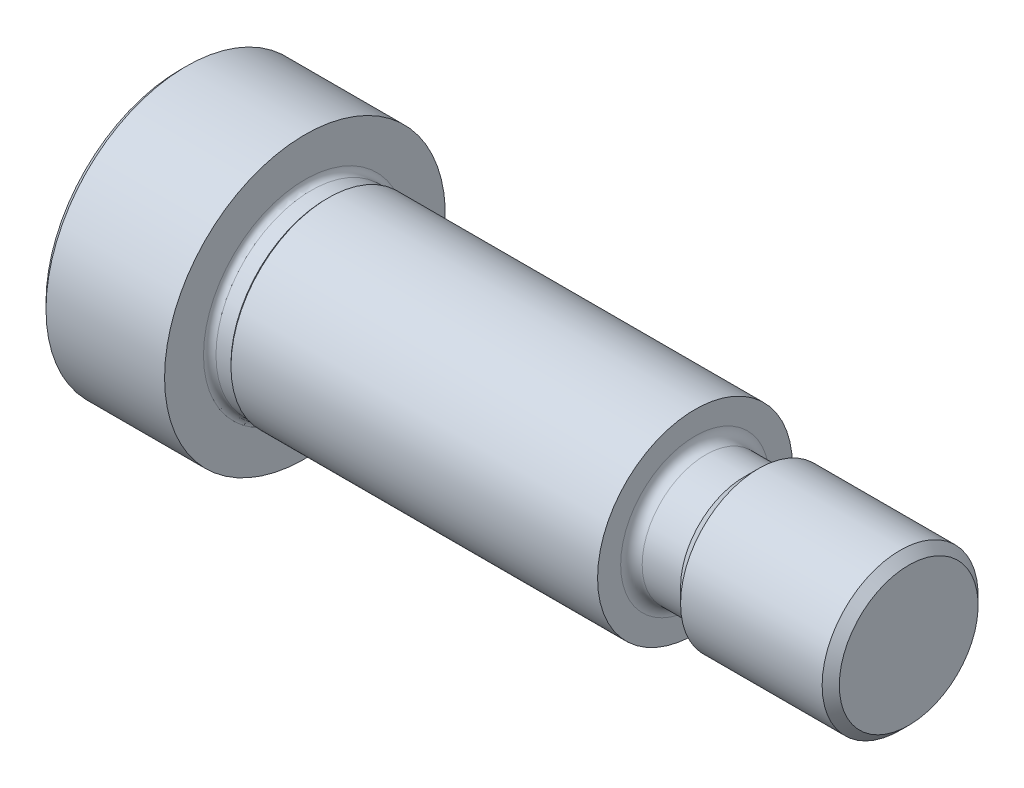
from build123d import *

# Parameters (mm, degrees)
CHAMFER1_SIZE = 0.8
HEX_2_DEPTH   = 10


with BuildPart() as part:
    # BodySke → BaseBody (revolve)
    with BuildSketch(Plane.XY, mode=Mode.PRIVATE) as basebody_sk:
        with BuildLine():
            Line((0, 0), (0, 18))
            Line((0, 18), (16, 18))
            Line((16, 18), (16, 13.01))
            ThreePointArc((16, 13.01), (16.234314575, 12.444314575), (16.8, 12.21))
            Line((16.8, 12.21), (18.72, 12.21))
            Line((18.72, 12.21), (19, 12.49))
            Line((19, 12.49), (66, 12.49))
            Line((66, 12.49), (66, 9.53))
            ThreePointArc((66, 9.53), (66.404192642, 8.554192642), (67.38, 8.15))
            Line((67.38, 8.15), (72.3, 8.15))
            Line((72.3, 8.15), (74.15, 10))
            Line((74.15, 10), (92.2985, 10))
            Line((92.2985, 10), (93.4, 8.8985))
            Line((93.4, 8.8985), (93.4, 0))
            Line((93.4, 0), (0, 0))
        make_face()
    revolve(basebody_sk.sketch.rotate(Axis((-6.35, 0, 0), (1, 0, 0)), 90), axis=Axis((-6.35, 0, 0), (1, 0, 0)))

    # Chamfer1
    chamfer1_edges = [part.edges().sort_by_distance(p)[0] for p in [
        (0, 0, -18),
    ]]
    chamfer(chamfer1_edges, length=CHAMFER1_SIZE)

    # Sketch2 → PreBroach (revolve, cut)
    with BuildSketch(Plane.XY, mode=Mode.PRIVATE) as prebroach_sk:
        Polygon((0, 6), (10, 6), (13.464101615, 0), (0, 0), align=None)
    revolve(prebroach_sk.sketch.rotate(Axis((0, 0, 0), (1, 0, 0)), 90), axis=Axis((0, 0, 0), (1, 0, 0)), mode=Mode.SUBTRACT)

    # Sketch3 → Hex 2 (cut)
    with BuildSketch(Plane.ZY):
        Polygon((-6, -3.464101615), (-6, 3.464101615), (0, 6.92820323), (6, 3.464101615), (6, -3.464101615), (0, -6.92820323), align=None)
    extrude(amount=-HEX_2_DEPTH, mode=Mode.SUBTRACT)


solid = part.part
